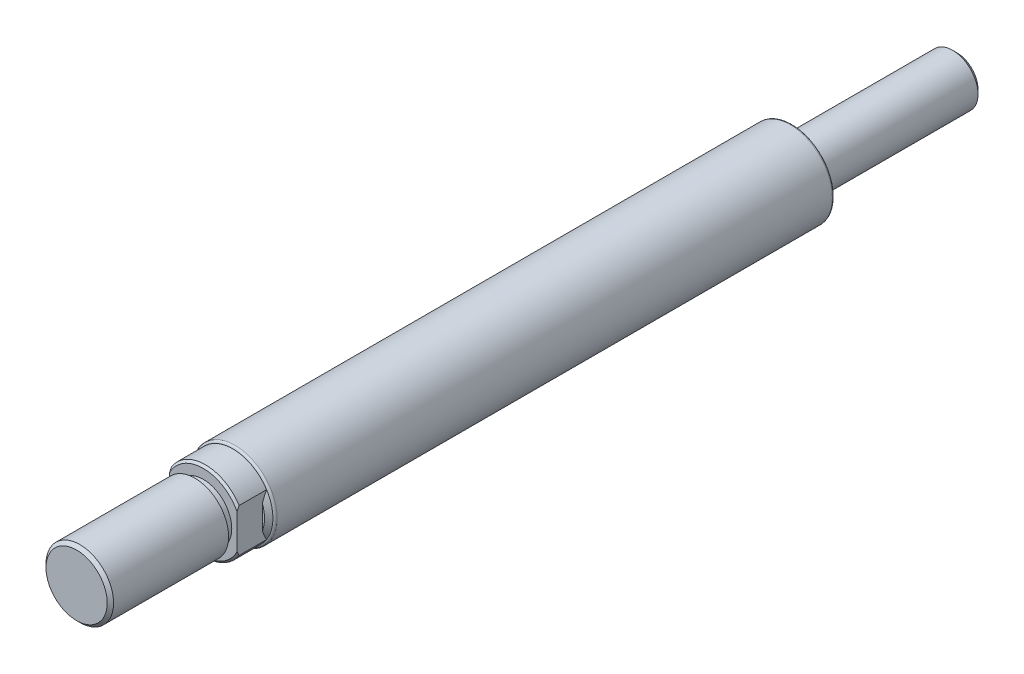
ISO-10303-21;
HEADER;
FILE_DESCRIPTION(('STEP AP214'),'2;1');
FILE_NAME('part.step','',(''),(''),'','','');
FILE_SCHEMA(('AUTOMOTIVE_DESIGN { 1 0 10303 214 1 1 1 1 }'));
ENDSEC;
DATA;
#1=APPLICATION_CONTEXT('core data for automotive mechanical design processes');
#2=APPLICATION_PROTOCOL_DEFINITION('international standard','automotive_design',2000,#1);
#3=PRODUCT_CONTEXT('',#1,'mechanical');
#4=PRODUCT('Part','Part','',(#3));
#5=PRODUCT_RELATED_PRODUCT_CATEGORY('part','',(#4));
#6=PRODUCT_DEFINITION_FORMATION('','',#4);
#7=PRODUCT_DEFINITION_CONTEXT('part definition',#1,'design');
#8=PRODUCT_DEFINITION('design','',#6,#7);
#9=PRODUCT_DEFINITION_SHAPE('','',#8);
#10=(LENGTH_UNIT() NAMED_UNIT(*) SI_UNIT(.MILLI.,.METRE.));
#11=(NAMED_UNIT(*) PLANE_ANGLE_UNIT() SI_UNIT($,.RADIAN.));
#12=(NAMED_UNIT(*) SI_UNIT($,.STERADIAN.) SOLID_ANGLE_UNIT());
#13=UNCERTAINTY_MEASURE_WITH_UNIT(LENGTH_MEASURE(1.E-05),#10,'distance_accuracy_value','');
#14=(GEOMETRIC_REPRESENTATION_CONTEXT(3) GLOBAL_UNCERTAINTY_ASSIGNED_CONTEXT((#13)) GLOBAL_UNIT_ASSIGNED_CONTEXT((#10,
#11,#12)) REPRESENTATION_CONTEXT('',''));
#15=CARTESIAN_POINT('',(0.,0.,0.));
#16=DIRECTION('',(0.,0.,1.));
#17=DIRECTION('',(1.,0.,0.));
#18=AXIS2_PLACEMENT_3D('',#15,#16,#17);
#19=CARTESIAN_POINT('',(0.,0.,30.));
#20=DIRECTION('',(0.,0.,1.));
#21=DIRECTION('',(0.999999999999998,0.,0.));
#22=AXIS2_PLACEMENT_3D('',#19,#20,#21);
#23=CYLINDRICAL_SURFACE('',#22,9.5);
#24=DIRECTION('',(0.,0.,1.));
#25=VECTOR('',#24,1.);
#26=CARTESIAN_POINT('',(8.00000000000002,5.12347538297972,30.));
#27=LINE('',#26,#25);
#28=CARTESIAN_POINT('',(8.00000000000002,5.12347538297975,-30.5));
#29=VERTEX_POINT('',#28);
#30=CARTESIAN_POINT('',(8.00000000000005,5.12347538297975,-37.));
#31=VERTEX_POINT('',#30);
#32=EDGE_CURVE('E233',#29,#31,#27,.F.);
#33=ORIENTED_EDGE('',*,*,#32,.T.);
#34=CARTESIAN_POINT('',(0.,0.,-37.));
#35=DIRECTION('',(0.,0.,1.));
#36=DIRECTION('',(0.999999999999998,0.,0.));
#37=AXIS2_PLACEMENT_3D('',#34,#35,#36);
#38=CIRCLE('',#37,9.5);
#39=CARTESIAN_POINT('',(-7.99999999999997,5.12347538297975,-37.));
#40=VERTEX_POINT('',#39);
#41=EDGE_CURVE('E243',#31,#40,#38,.T.);
#42=ORIENTED_EDGE('',*,*,#41,.T.);
#43=DIRECTION('',(0.,0.,1.));
#44=VECTOR('',#43,1.);
#45=CARTESIAN_POINT('',(-7.99999999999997,5.1234753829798,30.));
#46=LINE('',#45,#44);
#47=CARTESIAN_POINT('',(-7.99999999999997,5.12347538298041,-30.5));
#48=VERTEX_POINT('',#47);
#49=EDGE_CURVE('E267',#40,#48,#46,.T.);
#50=ORIENTED_EDGE('',*,*,#49,.T.);
#51=CARTESIAN_POINT('',(0.,0.,-30.5));
#52=DIRECTION('',(0.,0.,-1.));
#53=DIRECTION('',(-0.999999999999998,0.,0.));
#54=AXIS2_PLACEMENT_3D('',#51,#52,#53);
#55=CIRCLE('',#54,9.5);
#56=EDGE_CURVE('E134',#48,#29,#55,.T.);
#57=ORIENTED_EDGE('',*,*,#56,.T.);
#58=EDGE_LOOP('',(#33,#42,#50,#57));
#59=FACE_BOUND('',#58,.T.);
#60=ADVANCED_FACE('F38',(#59),#23,.T.);
#61=CARTESIAN_POINT('',(0.,0.,-30.));
#62=DIRECTION('',(0.,0.,-1.));
#63=DIRECTION('',(-0.999999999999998,0.,0.));
#64=AXIS2_PLACEMENT_3D('',#61,#62,#63);
#65=CONICAL_SURFACE('',#64,9.00000000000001,0.785398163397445);
#66=CARTESIAN_POINT('',(-7.99999999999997,-12.4805652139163,-35.824456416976));
#67=CARTESIAN_POINT('',(-7.99999999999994,-12.322472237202,-35.6913618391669));
#68=CARTESIAN_POINT('',(-7.99999999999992,-12.1640190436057,-35.5586953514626));
#69=CARTESIAN_POINT('',(-7.99999999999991,-11.8463165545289,-35.294315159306));
#70=CARTESIAN_POINT('',(-7.99999999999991,-11.6870672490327,-35.1626014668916));
#71=CARTESIAN_POINT('',(-7.99999999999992,-11.2079478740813,-34.7689821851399));
#72=CARTESIAN_POINT('',(-7.99999999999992,-10.8867753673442,-34.5086566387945));
#73=CARTESIAN_POINT('',(-7.99999999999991,-10.2380170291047,-33.9914726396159));
#74=CARTESIAN_POINT('',(-7.99999999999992,-9.91040226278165,-33.7346504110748));
#75=CARTESIAN_POINT('',(-7.99999999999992,-9.25001934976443,-33.22775645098));
#76=CARTESIAN_POINT('',(-7.99999999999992,-8.91725166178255,-32.9776841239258));
#77=CARTESIAN_POINT('',(-7.99999999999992,-8.25887278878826,-32.496113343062));
#78=CARTESIAN_POINT('',(-7.99999999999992,-7.9335129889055,-32.2642724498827));
#79=CARTESIAN_POINT('',(-7.99999999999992,-7.2755284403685,-31.810938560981));
#80=CARTESIAN_POINT('',(-7.99999999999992,-6.94290236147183,-31.5894474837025));
#81=CARTESIAN_POINT('',(-7.99999999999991,-6.26956184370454,-31.1607142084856));
#82=CARTESIAN_POINT('',(-7.9999999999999,-5.92886664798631,-30.9534419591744));
#83=CARTESIAN_POINT('',(-7.99999999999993,-5.23689572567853,-30.5574331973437));
#84=CARTESIAN_POINT('',(-7.99999999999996,-4.88562506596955,-30.3686879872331));
#85=CARTESIAN_POINT('',(-7.99999999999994,-4.37387150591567,-30.1166235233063));
#86=CARTESIAN_POINT('',(-7.99999999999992,-4.21844785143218,-30.0429980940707));
#87=CARTESIAN_POINT('',(-7.99999999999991,-3.90514290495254,-29.9011576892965));
#88=CARTESIAN_POINT('',(-7.99999999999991,-3.74726167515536,-29.832942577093));
#89=CARTESIAN_POINT('',(-7.99999999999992,-3.42918042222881,-29.702773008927));
#90=CARTESIAN_POINT('',(-7.99999999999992,-3.26898384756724,-29.6408101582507));
#91=CARTESIAN_POINT('',(-7.99999999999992,-2.94603757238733,-29.5238771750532));
#92=CARTESIAN_POINT('',(-7.99999999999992,-2.78328774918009,-29.4689073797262));
#93=CARTESIAN_POINT('',(-7.99999999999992,-2.45268168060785,-29.3660375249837));
#94=CARTESIAN_POINT('',(-7.99999999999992,-2.28478540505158,-29.3182653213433));
#95=CARTESIAN_POINT('',(-7.99999999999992,-1.94668439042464,-29.2318203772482));
#96=CARTESIAN_POINT('',(-7.99999999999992,-1.77648006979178,-29.1931460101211));
#97=CARTESIAN_POINT('',(-7.99999999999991,-1.43315589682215,-29.1256089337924));
#98=CARTESIAN_POINT('',(-7.99999999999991,-1.26002522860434,-29.0968006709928));
#99=CARTESIAN_POINT('',(-7.99999999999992,-0.912189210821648,-29.049979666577));
#100=CARTESIAN_POINT('',(-7.99999999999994,-0.737482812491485,-29.0319747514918));
#101=CARTESIAN_POINT('',(-7.99999999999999,-0.562330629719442,-29.0197391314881));
#102=B_SPLINE_CURVE_WITH_KNOTS('',3,(#66,#67,#68,#69,#70,#71,#72,#73,#74,#75,#76,#77,#78,#79,
#80,#81,#82,#83,#84,#85,#86,#87,#88,#89,#90,#91,#92,#93,#94,#95,#96,#97,#98,#99,#100,#101),
.UNSPECIFIED.,.F.,.F.,(4,2,2,2,2,2,2,2,2,2,2,2,2,2,2,2,2,4),(0.,0.619972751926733,
1.23995332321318,2.48018539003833,3.72895875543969,4.97762158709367,6.17600476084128,
7.37460919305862,8.57059692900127,9.76602049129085,10.2818793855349,10.7977252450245,
11.3128690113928,11.8280376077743,12.3514878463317,12.8748444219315,13.4010442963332,
13.9276249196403),.UNSPECIFIED.);
#103=CARTESIAN_POINT('',(-7.99999999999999,-5.12347538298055,-30.5));
#104=VERTEX_POINT('',#103);
#105=CARTESIAN_POINT('',(-7.99999999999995,-4.12310562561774,-30.0000000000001));
#106=VERTEX_POINT('',#105);
#107=EDGE_CURVE('E105',#104,#106,#102,.T.);
#108=ORIENTED_EDGE('',*,*,#107,.F.);
#109=CARTESIAN_POINT('',(8.00000000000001,-5.12347538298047,-30.5000000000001));
#110=VERTEX_POINT('',#109);
#111=EDGE_CURVE('E140',#110,#104,#55,.T.);
#112=ORIENTED_EDGE('',*,*,#111,.F.);
#113=CARTESIAN_POINT('',(7.99999999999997,-0.562330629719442,-29.019739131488));
#114=CARTESIAN_POINT('',(8.00000000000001,-0.692953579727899,-29.0288830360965));
#115=CARTESIAN_POINT('',(8.00000000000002,-0.823340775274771,-29.0412160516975));
#116=CARTESIAN_POINT('',(8.00000000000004,-1.08335782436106,-29.071992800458));
#117=CARTESIAN_POINT('',(8.00000000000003,-1.21298787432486,-29.0904348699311));
#118=CARTESIAN_POINT('',(8.00000000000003,-1.47102175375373,-29.133125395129));
#119=CARTESIAN_POINT('',(8.00000000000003,-1.59942749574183,-29.1573623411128));
#120=CARTESIAN_POINT('',(8.00000000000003,-1.85508108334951,-29.211315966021));
#121=CARTESIAN_POINT('',(8.00000000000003,-1.98232885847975,-29.2410329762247));
#122=CARTESIAN_POINT('',(8.00000000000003,-2.35920384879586,-29.3371043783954));
#123=CARTESIAN_POINT('',(8.00000000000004,-2.60695772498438,-29.4108917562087));
#124=CARTESIAN_POINT('',(8.00000000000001,-3.0967823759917,-29.5753571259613));
#125=CARTESIAN_POINT('',(7.99999999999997,-3.33885159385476,-29.6660396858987));
#126=CARTESIAN_POINT('',(8.00000000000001,-3.65836579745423,-29.7964917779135));
#127=CARTESIAN_POINT('',(8.00000000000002,-3.73838694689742,-29.8300828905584));
#128=CARTESIAN_POINT('',(8.00000000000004,-3.89777984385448,-29.8987366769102));
#129=CARTESIAN_POINT('',(8.00000000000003,-3.97715171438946,-29.9337990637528));
#130=CARTESIAN_POINT('',(8.00000000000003,-4.13548600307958,-30.0054007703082));
#131=CARTESIAN_POINT('',(8.00000000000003,-4.21444671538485,-30.0419438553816));
#132=CARTESIAN_POINT('',(8.00000000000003,-4.37174909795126,-30.1163258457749));
#133=CARTESIAN_POINT('',(8.00000000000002,-4.45009079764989,-30.1541646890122));
#134=CARTESIAN_POINT('',(7.99999999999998,-4.89771562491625,-30.3746464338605));
#135=CARTESIAN_POINT('',(8.00000000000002,-5.2606780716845,-30.5702240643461));
#136=CARTESIAN_POINT('',(8.00000000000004,-5.97540383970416,-30.9809788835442));
#137=CARTESIAN_POINT('',(8.00000000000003,-6.32716009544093,-31.1961681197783));
#138=CARTESIAN_POINT('',(8.00000000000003,-7.02247411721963,-31.6416036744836));
#139=CARTESIAN_POINT('',(8.00000000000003,-7.36600352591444,-31.8718940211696));
#140=CARTESIAN_POINT('',(8.00000000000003,-8.0454281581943,-32.3432410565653));
#141=CARTESIAN_POINT('',(8.00000000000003,-8.38132509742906,-32.5842952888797));
#142=CARTESIAN_POINT('',(8.00000000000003,-9.03826974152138,-33.0682362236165));
#143=CARTESIAN_POINT('',(8.00000000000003,-9.35947580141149,-33.3109088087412));
#144=CARTESIAN_POINT('',(8.00000000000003,-9.99716232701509,-33.8024231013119));
#145=CARTESIAN_POINT('',(8.00000000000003,-10.3136423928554,-34.0512653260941));
#146=CARTESIAN_POINT('',(8.00000000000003,-10.9403768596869,-34.5519926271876));
#147=CARTESIAN_POINT('',(8.00000000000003,-11.250659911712,-34.8038419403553));
#148=CARTESIAN_POINT('',(8.00000000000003,-11.8679206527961,-35.3114344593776));
#149=CARTESIAN_POINT('',(8.00000000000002,-12.1748990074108,-35.5671768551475));
#150=CARTESIAN_POINT('',(8.00000000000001,-12.4805652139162,-35.824456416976));
#151=B_SPLINE_CURVE_WITH_KNOTS('',3,(#113,#114,#115,#116,#117,#118,#119,#120,#121,#122,#123,
#124,#125,#126,#127,#128,#129,#130,#131,#132,#133,#134,#135,#136,#137,#138,#139,#140,#141,#142,
#143,#144,#145,#146,#147,#148,#149,#150),.UNSPECIFIED.,.F.,.F.,(4,2,2,2,2,2,2,2,2,2,2,2,2,2,2,2,
2,2,4),(0.,0.392770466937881,0.785434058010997,1.17732412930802,1.56923789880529,
2.34397803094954,3.11892793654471,3.37927663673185,3.63957480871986,3.90058251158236,
4.16157772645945,5.39748103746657,6.63414875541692,7.87459784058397,9.11476527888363,
10.3223857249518,11.5301077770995,12.7289611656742,13.927568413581),.UNSPECIFIED.);
#152=CARTESIAN_POINT('',(7.99999999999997,-4.12310562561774,-30.0000000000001));
#153=VERTEX_POINT('',#152);
#154=EDGE_CURVE('E131',#153,#110,#151,.T.);
#155=ORIENTED_EDGE('',*,*,#154,.F.);
#156=CARTESIAN_POINT('',(0.,0.,-30.));
#157=DIRECTION('',(0.,0.,-1.));
#158=DIRECTION('',(-0.999999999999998,0.,0.));
#159=AXIS2_PLACEMENT_3D('',#156,#157,#158);
#160=CIRCLE('',#159,9.00000000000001);
#161=EDGE_CURVE('E123',#106,#153,#160,.F.);
#162=ORIENTED_EDGE('',*,*,#161,.F.);
#163=EDGE_LOOP('',(#108,#112,#155,#162));
#164=FACE_BOUND('',#163,.T.);
#165=ADVANCED_FACE('F130',(#164),#65,.T.);
#166=CARTESIAN_POINT('',(0.,0.,0.));
#167=DIRECTION('',(0.,0.,-1.));
#168=DIRECTION('',(-0.999999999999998,0.,0.));
#169=AXIS2_PLACEMENT_3D('',#166,#167,#168);
#170=PLANE('',#169);
#171=CARTESIAN_POINT('',(0.,0.,0.));
#172=DIRECTION('',(0.,0.,-1.));
#173=DIRECTION('',(-0.999999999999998,0.,0.));
#174=AXIS2_PLACEMENT_3D('',#171,#172,#173);
#175=CIRCLE('',#174,7.25);
#176=CARTESIAN_POINT('',(-7.24999999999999,0.,0.));
#177=VERTEX_POINT('',#176);
#178=EDGE_CURVE('E136',#177,#177,#175,.F.);
#179=ORIENTED_EDGE('',*,*,#178,.T.);
#180=EDGE_LOOP('',(#179));
#181=FACE_BOUND('',#180,.T.);
#182=ADVANCED_FACE('F40',(#181),#170,.F.);
#183=CARTESIAN_POINT('',(0.,0.,30.));
#184=DIRECTION('',(0.,0.,1.));
#185=DIRECTION('',(0.999999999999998,0.,0.));
#186=AXIS2_PLACEMENT_3D('',#183,#184,#185);
#187=CYLINDRICAL_SURFACE('',#186,8.);
#188=CARTESIAN_POINT('',(0.,0.,-0.750000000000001));
#189=DIRECTION('',(0.,0.,-1.));
#190=DIRECTION('',(-0.999999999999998,0.,0.));
#191=AXIS2_PLACEMENT_3D('',#188,#189,#190);
#192=CIRCLE('',#191,8.);
#193=CARTESIAN_POINT('',(-7.99999999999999,0.,-0.750000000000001));
#194=VERTEX_POINT('',#193);
#195=EDGE_CURVE('E132',#194,#194,#192,.T.);
#196=ORIENTED_EDGE('',*,*,#195,.T.);
#197=EDGE_LOOP('',(#196));
#198=FACE_BOUND('',#197,.T.);
#199=CARTESIAN_POINT('',(0.,0.,-28.));
#200=DIRECTION('',(0.,0.,1.));
#201=DIRECTION('',(0.999999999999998,0.,0.));
#202=AXIS2_PLACEMENT_3D('',#199,#200,#201);
#203=CIRCLE('',#202,8.);
#204=CARTESIAN_POINT('',(7.99999999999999,0.,-28.));
#205=VERTEX_POINT('',#204);
#206=EDGE_CURVE('E357',#205,#205,#203,.T.);
#207=ORIENTED_EDGE('',*,*,#206,.T.);
#208=EDGE_LOOP('',(#207));
#209=FACE_BOUND('',#208,.T.);
#210=ADVANCED_FACE('F373',(#198,#209),#187,.T.);
#211=CARTESIAN_POINT('',(0.,7.99999999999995,-28.0000000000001));
#212=DIRECTION('',(0.,0.,1.));
#213=DIRECTION('',(0.999999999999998,0.,0.));
#214=AXIS2_PLACEMENT_3D('',#211,#212,#213);
#215=PLANE('',#214);
#216=ORIENTED_EDGE('',*,*,#206,.F.);
#217=EDGE_LOOP('',(#216));
#218=FACE_BOUND('',#217,.T.);
#219=CARTESIAN_POINT('',(0.,0.,-28.));
#220=DIRECTION('',(0.,0.,1.));
#221=DIRECTION('',(0.999999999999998,0.,0.));
#222=AXIS2_PLACEMENT_3D('',#219,#220,#221);
#223=CIRCLE('',#222,6.75);
#224=CARTESIAN_POINT('',(6.74999999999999,0.,-28.));
#225=VERTEX_POINT('',#224);
#226=EDGE_CURVE('E254',#225,#225,#223,.T.);
#227=ORIENTED_EDGE('',*,*,#226,.T.);
#228=EDGE_LOOP('',(#227));
#229=FACE_BOUND('',#228,.T.);
#230=ADVANCED_FACE('F364',(#218,#229),#215,.F.);
#231=CARTESIAN_POINT('',(0.,0.,30.));
#232=DIRECTION('',(0.,0.,1.));
#233=DIRECTION('',(0.999999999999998,0.,0.));
#234=AXIS2_PLACEMENT_3D('',#231,#232,#233);
#235=CYLINDRICAL_SURFACE('',#234,6.75);
#236=ORIENTED_EDGE('',*,*,#226,.F.);
#237=EDGE_LOOP('',(#236));
#238=FACE_BOUND('',#237,.T.);
#239=CARTESIAN_POINT('',(0.,0.,-30.));
#240=DIRECTION('',(0.,0.,1.));
#241=DIRECTION('',(0.999999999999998,0.,0.));
#242=AXIS2_PLACEMENT_3D('',#239,#240,#241);
#243=CIRCLE('',#242,6.75);
#244=CARTESIAN_POINT('',(6.74999999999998,0.,-30.));
#245=VERTEX_POINT('',#244);
#246=EDGE_CURVE('E251',#245,#245,#243,.T.);
#247=ORIENTED_EDGE('',*,*,#246,.T.);
#248=EDGE_LOOP('',(#247));
#249=FACE_BOUND('',#248,.T.);
#250=ADVANCED_FACE('F283',(#238,#249),#235,.T.);
#251=CARTESIAN_POINT('',(0.,6.74999999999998,-30.0000000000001));
#252=DIRECTION('',(0.,0.,-1.));
#253=DIRECTION('',(-0.999999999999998,0.,0.));
#254=AXIS2_PLACEMENT_3D('',#251,#252,#253);
#255=PLANE('',#254);
#256=CARTESIAN_POINT('',(8.00000000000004,4.12310562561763,-30.));
#257=VERTEX_POINT('',#256);
#258=CARTESIAN_POINT('',(-7.99999999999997,4.12310562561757,-30.));
#259=VERTEX_POINT('',#258);
#260=EDGE_CURVE('E126',#257,#259,#160,.F.);
#261=ORIENTED_EDGE('',*,*,#260,.T.);
#262=DIRECTION('',(0.,0.999999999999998,0.));
#263=VECTOR('',#262,1.);
#264=CARTESIAN_POINT('',(-7.99999999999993,5.99999999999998,-30.));
#265=LINE('',#264,#263);
#266=EDGE_CURVE('E108',#106,#259,#265,.T.);
#267=ORIENTED_EDGE('',*,*,#266,.F.);
#268=ORIENTED_EDGE('',*,*,#161,.T.);
#269=DIRECTION('',(0.,-0.999999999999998,0.));
#270=VECTOR('',#269,1.);
#271=CARTESIAN_POINT('',(8.00000000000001,6.,-30.));
#272=LINE('',#271,#270);
#273=EDGE_CURVE('E234',#257,#153,#272,.T.);
#274=ORIENTED_EDGE('',*,*,#273,.F.);
#275=EDGE_LOOP('',(#261,#267,#268,#274));
#276=FACE_BOUND('',#275,.T.);
#277=ORIENTED_EDGE('',*,*,#246,.F.);
#278=EDGE_LOOP('',(#277));
#279=FACE_BOUND('',#278,.T.);
#280=ADVANCED_FACE('F120',(#276,#279),#255,.F.);
#281=CARTESIAN_POINT('',(-7.99999999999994,-5.12347538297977,-37.));
#282=VERTEX_POINT('',#281);
#283=CARTESIAN_POINT('',(7.99999999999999,-5.12347538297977,-37.));
#284=VERTEX_POINT('',#283);
#285=EDGE_CURVE('E256',#282,#284,#38,.T.);
#286=ORIENTED_EDGE('',*,*,#285,.T.);
#287=DIRECTION('',(0.,0.,1.));
#288=VECTOR('',#287,1.);
#289=CARTESIAN_POINT('',(7.99999999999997,-5.12347538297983,29.9999999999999));
#290=LINE('',#289,#288);
#291=EDGE_CURVE('E227',#284,#110,#290,.T.);
#292=ORIENTED_EDGE('',*,*,#291,.T.);
#293=ORIENTED_EDGE('',*,*,#111,.T.);
#294=DIRECTION('',(0.,0.,1.));
#295=VECTOR('',#294,1.);
#296=CARTESIAN_POINT('',(-8.,-5.12347538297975,30.));
#297=LINE('',#296,#295);
#298=EDGE_CURVE('E110',#104,#282,#297,.F.);
#299=ORIENTED_EDGE('',*,*,#298,.T.);
#300=EDGE_LOOP('',(#286,#292,#293,#299));
#301=FACE_BOUND('',#300,.T.);
#302=ADVANCED_FACE('F272',(#301),#23,.T.);
#303=CARTESIAN_POINT('',(0.,0.,30.));
#304=DIRECTION('',(0.,0.,1.));
#305=DIRECTION('',(0.999999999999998,0.,0.));
#306=AXIS2_PLACEMENT_3D('',#303,#304,#305);
#307=CYLINDRICAL_SURFACE('',#306,10.);
#308=CARTESIAN_POINT('',(0.,0.,-37.5000000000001));
#309=DIRECTION('',(0.,0.,-1.));
#310=DIRECTION('',(-0.999999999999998,0.,0.));
#311=AXIS2_PLACEMENT_3D('',#308,#309,#310);
#312=CIRCLE('',#311,10.);
#313=CARTESIAN_POINT('',(-9.99999999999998,0.,-37.5000000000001));
#314=VERTEX_POINT('',#313);
#315=EDGE_CURVE('E145',#314,#314,#312,.T.);
#316=ORIENTED_EDGE('',*,*,#315,.T.);
#317=EDGE_LOOP('',(#316));
#318=FACE_BOUND('',#317,.T.);
#319=CARTESIAN_POINT('',(0.,0.,-169.));
#320=DIRECTION('',(0.,0.,1.));
#321=DIRECTION('',(0.999999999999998,0.,0.));
#322=AXIS2_PLACEMENT_3D('',#319,#320,#321);
#323=CIRCLE('',#322,10.);
#324=CARTESIAN_POINT('',(9.99999999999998,0.,-169.));
#325=VERTEX_POINT('',#324);
#326=EDGE_CURVE('E142',#325,#325,#323,.T.);
#327=ORIENTED_EDGE('',*,*,#326,.T.);
#328=EDGE_LOOP('',(#327));
#329=FACE_BOUND('',#328,.T.);
#330=ADVANCED_FACE('F274',(#318,#329),#307,.T.);
#331=CARTESIAN_POINT('',(0.,9.99999999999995,-169.5));
#332=DIRECTION('',(0.,0.,1.));
#333=DIRECTION('',(0.999999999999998,0.,0.));
#334=AXIS2_PLACEMENT_3D('',#331,#332,#333);
#335=PLANE('',#334);
#336=CARTESIAN_POINT('',(0.,0.,-169.5));
#337=DIRECTION('',(0.,0.,1.));
#338=DIRECTION('',(0.999999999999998,0.,0.));
#339=AXIS2_PLACEMENT_3D('',#336,#337,#338);
#340=CIRCLE('',#339,9.5);
#341=CARTESIAN_POINT('',(9.49999999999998,0.,-169.5));
#342=VERTEX_POINT('',#341);
#343=EDGE_CURVE('E148',#342,#342,#340,.F.);
#344=ORIENTED_EDGE('',*,*,#343,.T.);
#345=EDGE_LOOP('',(#344));
#346=FACE_BOUND('',#345,.T.);
#347=CARTESIAN_POINT('',(0.,0.,-169.5));
#348=DIRECTION('',(0.,0.,1.));
#349=DIRECTION('',(0.999999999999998,0.,0.));
#350=AXIS2_PLACEMENT_3D('',#347,#348,#349);
#351=CIRCLE('',#350,6.);
#352=CARTESIAN_POINT('',(5.99999999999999,0.,-169.5));
#353=VERTEX_POINT('',#352);
#354=EDGE_CURVE('E258',#353,#353,#351,.T.);
#355=ORIENTED_EDGE('',*,*,#354,.T.);
#356=EDGE_LOOP('',(#355));
#357=FACE_BOUND('',#356,.T.);
#358=ADVANCED_FACE('F280',(#346,#357),#335,.F.);
#359=CARTESIAN_POINT('',(0.,0.,30.));
#360=DIRECTION('',(0.,0.,1.));
#361=DIRECTION('',(0.999999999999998,0.,0.));
#362=AXIS2_PLACEMENT_3D('',#359,#360,#361);
#363=CYLINDRICAL_SURFACE('',#362,6.);
#364=CARTESIAN_POINT('',(0.,0.,-207.5));
#365=DIRECTION('',(0.,0.,1.));
#366=DIRECTION('',(0.999999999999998,0.,0.));
#367=AXIS2_PLACEMENT_3D('',#364,#365,#366);
#368=CIRCLE('',#367,6.);
#369=CARTESIAN_POINT('',(6.,0.,-207.5));
#370=VERTEX_POINT('',#369);
#371=EDGE_CURVE('E151',#370,#370,#368,.T.);
#372=ORIENTED_EDGE('',*,*,#371,.T.);
#373=EDGE_LOOP('',(#372));
#374=FACE_BOUND('',#373,.T.);
#375=ORIENTED_EDGE('',*,*,#354,.F.);
#376=EDGE_LOOP('',(#375));
#377=FACE_BOUND('',#376,.T.);
#378=ADVANCED_FACE('F304',(#374,#377),#363,.T.);
#379=CARTESIAN_POINT('',(0.,5.99999999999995,-208.5));
#380=DIRECTION('',(0.,0.,1.));
#381=DIRECTION('',(0.999999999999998,0.,0.));
#382=AXIS2_PLACEMENT_3D('',#379,#380,#381);
#383=PLANE('',#382);
#384=CARTESIAN_POINT('',(0.,0.,-208.5));
#385=DIRECTION('',(0.,0.,1.));
#386=DIRECTION('',(0.999999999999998,0.,0.));
#387=AXIS2_PLACEMENT_3D('',#384,#385,#386);
#388=CIRCLE('',#387,4.99999999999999);
#389=CARTESIAN_POINT('',(4.99999999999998,0.,-208.5));
#390=VERTEX_POINT('',#389);
#391=EDGE_CURVE('E154',#390,#390,#388,.F.);
#392=ORIENTED_EDGE('',*,*,#391,.T.);
#393=EDGE_LOOP('',(#392));
#394=FACE_BOUND('',#393,.T.);
#395=ADVANCED_FACE('F299',(#394),#383,.F.);
#396=CARTESIAN_POINT('',(0.,0.,0.));
#397=DIRECTION('',(0.,0.,-1.));
#398=DIRECTION('',(-0.999999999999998,0.,0.));
#399=AXIS2_PLACEMENT_3D('',#396,#397,#398);
#400=CONICAL_SURFACE('',#399,7.25,0.785398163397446);
#401=ORIENTED_EDGE('',*,*,#195,.F.);
#402=EDGE_LOOP('',(#401));
#403=FACE_BOUND('',#402,.T.);
#404=ORIENTED_EDGE('',*,*,#178,.F.);
#405=EDGE_LOOP('',(#404));
#406=FACE_BOUND('',#405,.T.);
#407=ADVANCED_FACE('F292',(#403,#406),#400,.T.);
#408=CARTESIAN_POINT('',(-7.99999999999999,0.562330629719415,-29.019739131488));
#409=CARTESIAN_POINT('',(-7.99999999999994,0.692953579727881,-29.0288830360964));
#410=CARTESIAN_POINT('',(-7.99999999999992,0.823340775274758,-29.0412160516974));
#411=CARTESIAN_POINT('',(-7.99999999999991,1.08335782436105,-29.0719928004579));
#412=CARTESIAN_POINT('',(-7.99999999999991,1.21298787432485,-29.090434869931));
#413=CARTESIAN_POINT('',(-7.99999999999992,1.47102175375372,-29.1331253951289));
#414=CARTESIAN_POINT('',(-7.99999999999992,1.5994274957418,-29.1573623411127));
#415=CARTESIAN_POINT('',(-7.99999999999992,1.85508108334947,-29.2113159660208));
#416=CARTESIAN_POINT('',(-7.99999999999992,1.98232885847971,-29.2410329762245));
#417=CARTESIAN_POINT('',(-7.99999999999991,2.35920384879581,-29.3371043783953));
#418=CARTESIAN_POINT('',(-7.9999999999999,2.60695772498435,-29.4108917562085));
#419=CARTESIAN_POINT('',(-7.99999999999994,3.09678237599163,-29.5753571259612));
#420=CARTESIAN_POINT('',(-7.99999999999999,3.33885159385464,-29.6660396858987));
#421=CARTESIAN_POINT('',(-7.99999999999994,3.65836579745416,-29.7964917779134));
#422=CARTESIAN_POINT('',(-7.99999999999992,3.73838694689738,-29.8300828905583));
#423=CARTESIAN_POINT('',(-7.99999999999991,3.89777984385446,-29.89873667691));
#424=CARTESIAN_POINT('',(-7.99999999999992,3.97715171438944,-29.9337990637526));
#425=CARTESIAN_POINT('',(-7.99999999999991,4.13548600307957,-30.0054007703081));
#426=CARTESIAN_POINT('',(-7.99999999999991,4.21444671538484,-30.0419438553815));
#427=CARTESIAN_POINT('',(-7.99999999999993,4.37174909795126,-30.1163258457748));
#428=CARTESIAN_POINT('',(-7.99999999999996,4.45009079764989,-30.1541646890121));
#429=CARTESIAN_POINT('',(-8.00000000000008,4.89771562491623,-30.3746464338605));
#430=CARTESIAN_POINT('',(-7.99999999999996,5.2606780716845,-30.570224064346));
#431=CARTESIAN_POINT('',(-7.99999999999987,5.97540383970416,-30.980978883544));
#432=CARTESIAN_POINT('',(-7.9999999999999,6.32716009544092,-31.1961681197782));
#433=CARTESIAN_POINT('',(-7.99999999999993,7.02247411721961,-31.6416036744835));
#434=CARTESIAN_POINT('',(-7.99999999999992,7.36600352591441,-31.8718940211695));
#435=CARTESIAN_POINT('',(-7.99999999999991,8.04542815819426,-32.3432410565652));
#436=CARTESIAN_POINT('',(-7.99999999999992,8.38132509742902,-32.5842952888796));
#437=CARTESIAN_POINT('',(-7.99999999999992,9.03826974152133,-33.0682362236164));
#438=CARTESIAN_POINT('',(-7.99999999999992,9.35947580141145,-33.3109088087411));
#439=CARTESIAN_POINT('',(-7.99999999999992,9.99716232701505,-33.8024231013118));
#440=CARTESIAN_POINT('',(-7.99999999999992,10.3136423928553,-34.051265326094));
#441=CARTESIAN_POINT('',(-7.99999999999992,10.9403768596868,-34.5519926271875));
#442=CARTESIAN_POINT('',(-7.99999999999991,11.250659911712,-34.8038419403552));
#443=CARTESIAN_POINT('',(-7.99999999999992,11.8679206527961,-35.3114344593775));
#444=CARTESIAN_POINT('',(-7.99999999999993,12.1748990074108,-35.5671768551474));
#445=CARTESIAN_POINT('',(-7.99999999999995,12.4805652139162,-35.8244564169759));
#446=B_SPLINE_CURVE_WITH_KNOTS('',3,(#408,#409,#410,#411,#412,#413,#414,#415,#416,#417,#418,
#419,#420,#421,#422,#423,#424,#425,#426,#427,#428,#429,#430,#431,#432,#433,#434,#435,#436,#437,
#438,#439,#440,#441,#442,#443,#444,#445),.UNSPECIFIED.,.F.,.F.,(4,2,2,2,2,2,2,2,2,2,2,2,2,2,2,2,
2,2,4),(0.,0.392770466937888,0.785434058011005,1.17732412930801,1.56923789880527,
2.3439780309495,3.11892793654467,3.37927663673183,3.63957480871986,3.90058251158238,
4.16157772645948,5.39748103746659,6.63414875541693,7.87459784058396,9.1147652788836,
10.3223857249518,11.5301077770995,12.7289611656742,13.9275684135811),.UNSPECIFIED.);
#447=EDGE_CURVE('E116',#259,#48,#446,.T.);
#448=ORIENTED_EDGE('',*,*,#447,.F.);
#449=ORIENTED_EDGE('',*,*,#260,.F.);
#450=CARTESIAN_POINT('',(8.00000000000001,12.4805652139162,-35.8244564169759));
#451=CARTESIAN_POINT('',(8.00000000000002,12.3224722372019,-35.6913618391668));
#452=CARTESIAN_POINT('',(8.00000000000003,12.1640190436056,-35.5586953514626));
#453=CARTESIAN_POINT('',(8.00000000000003,11.8463165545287,-35.294315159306));
#454=CARTESIAN_POINT('',(8.00000000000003,11.6870672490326,-35.1626014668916));
#455=CARTESIAN_POINT('',(8.00000000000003,11.2079478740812,-34.7689821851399));
#456=CARTESIAN_POINT('',(8.00000000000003,10.8867753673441,-34.5086566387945));
#457=CARTESIAN_POINT('',(8.00000000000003,10.2380170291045,-33.9914726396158));
#458=CARTESIAN_POINT('',(8.00000000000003,9.91040226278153,-33.7346504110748));
#459=CARTESIAN_POINT('',(8.00000000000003,9.25001934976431,-33.22775645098));
#460=CARTESIAN_POINT('',(8.00000000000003,8.91725166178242,-32.9776841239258));
#461=CARTESIAN_POINT('',(8.00000000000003,8.25887278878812,-32.496113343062));
#462=CARTESIAN_POINT('',(8.00000000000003,7.93351298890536,-32.2642724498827));
#463=CARTESIAN_POINT('',(8.00000000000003,7.27552844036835,-31.810938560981));
#464=CARTESIAN_POINT('',(8.00000000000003,6.94290236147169,-31.5894474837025));
#465=CARTESIAN_POINT('',(8.00000000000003,6.26956184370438,-31.1607142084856));
#466=CARTESIAN_POINT('',(8.00000000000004,5.92886664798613,-30.9534419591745));
#467=CARTESIAN_POINT('',(8.00000000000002,5.2368957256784,-30.5574331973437));
#468=CARTESIAN_POINT('',(7.99999999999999,4.88562506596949,-30.3686879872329));
#469=CARTESIAN_POINT('',(8.00000000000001,4.37387150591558,-30.1166235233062));
#470=CARTESIAN_POINT('',(8.00000000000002,4.21844785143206,-30.0429980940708));
#471=CARTESIAN_POINT('',(8.00000000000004,3.9051429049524,-29.9011576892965));
#472=CARTESIAN_POINT('',(8.00000000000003,3.74726167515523,-29.8329425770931));
#473=CARTESIAN_POINT('',(8.00000000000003,3.42918042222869,-29.7027730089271));
#474=CARTESIAN_POINT('',(8.00000000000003,3.26898384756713,-29.6408101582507));
#475=CARTESIAN_POINT('',(8.00000000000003,2.94603757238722,-29.5238771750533));
#476=CARTESIAN_POINT('',(8.00000000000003,2.78328774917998,-29.4689073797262));
#477=CARTESIAN_POINT('',(8.00000000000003,2.45268168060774,-29.3660375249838));
#478=CARTESIAN_POINT('',(8.00000000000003,2.28478540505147,-29.3182653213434));
#479=CARTESIAN_POINT('',(8.00000000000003,1.94668439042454,-29.2318203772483));
#480=CARTESIAN_POINT('',(8.00000000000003,1.77648006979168,-29.1931460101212));
#481=CARTESIAN_POINT('',(8.00000000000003,1.43315589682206,-29.1256089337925));
#482=CARTESIAN_POINT('',(8.00000000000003,1.26002522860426,-29.0968006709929));
#483=CARTESIAN_POINT('',(8.00000000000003,0.912189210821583,-29.0499796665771));
#484=CARTESIAN_POINT('',(8.00000000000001,0.737482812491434,-29.0319747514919));
#485=CARTESIAN_POINT('',(7.99999999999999,0.562330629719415,-29.019739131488));
#486=B_SPLINE_CURVE_WITH_KNOTS('',3,(#450,#451,#452,#453,#454,#455,#456,#457,#458,#459,#460,
#461,#462,#463,#464,#465,#466,#467,#468,#469,#470,#471,#472,#473,#474,#475,#476,#477,#478,#479,
#480,#481,#482,#483,#484,#485),.UNSPECIFIED.,.F.,.F.,(4,2,2,2,2,2,2,2,2,2,2,2,2,2,2,2,2,4),(0.,
0.61997275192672,1.23995332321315,2.4801853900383,3.72895875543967,4.97762158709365,
6.17600476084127,7.37460919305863,8.57059692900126,9.76602049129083,10.2818793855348,
10.7977252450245,11.3128690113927,11.8280376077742,12.3514878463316,12.8748444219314,
13.4010442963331,13.9276249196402),.UNSPECIFIED.);
#487=EDGE_CURVE('E157',#29,#257,#486,.T.);
#488=ORIENTED_EDGE('',*,*,#487,.F.);
#489=ORIENTED_EDGE('',*,*,#56,.F.);
#490=EDGE_LOOP('',(#448,#449,#488,#489));
#491=FACE_BOUND('',#490,.T.);
#492=ADVANCED_FACE('F168',(#491),#65,.T.);
#493=CARTESIAN_POINT('',(0.,0.,-37.5000000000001));
#494=DIRECTION('',(0.,0.,-1.));
#495=DIRECTION('',(-0.999999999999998,0.,0.));
#496=AXIS2_PLACEMENT_3D('',#493,#494,#495);
#497=TOROIDAL_SURFACE('',#496,9.5,0.5);
#498=ORIENTED_EDGE('',*,*,#315,.F.);
#499=EDGE_LOOP('',(#498));
#500=FACE_BOUND('',#499,.T.);
#501=ORIENTED_EDGE('',*,*,#41,.F.);
#502=EDGE_CURVE('E236',#284,#31,#38,.T.);
#503=ORIENTED_EDGE('',*,*,#502,.F.);
#504=ORIENTED_EDGE('',*,*,#285,.F.);
#505=EDGE_CURVE('E248',#40,#282,#38,.T.);
#506=ORIENTED_EDGE('',*,*,#505,.F.);
#507=EDGE_LOOP('',(#501,#503,#504,#506));
#508=FACE_BOUND('',#507,.T.);
#509=ADVANCED_FACE('F244',(#500,#508),#497,.T.);
#510=CARTESIAN_POINT('',(0.,0.,-169.));
#511=DIRECTION('',(0.,0.,1.));
#512=DIRECTION('',(0.999999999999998,0.,0.));
#513=AXIS2_PLACEMENT_3D('',#510,#511,#512);
#514=TOROIDAL_SURFACE('',#513,9.5,0.5);
#515=ORIENTED_EDGE('',*,*,#343,.F.);
#516=EDGE_LOOP('',(#515));
#517=FACE_BOUND('',#516,.T.);
#518=ORIENTED_EDGE('',*,*,#326,.F.);
#519=EDGE_LOOP('',(#518));
#520=FACE_BOUND('',#519,.T.);
#521=ADVANCED_FACE('F297',(#517,#520),#514,.T.);
#522=CARTESIAN_POINT('',(0.,0.,-207.5));
#523=DIRECTION('',(0.,0.,1.));
#524=DIRECTION('',(0.999999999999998,0.,0.));
#525=AXIS2_PLACEMENT_3D('',#522,#523,#524);
#526=CONICAL_SURFACE('',#525,6.,0.785398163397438);
#527=ORIENTED_EDGE('',*,*,#391,.F.);
#528=EDGE_LOOP('',(#527));
#529=FACE_BOUND('',#528,.T.);
#530=ORIENTED_EDGE('',*,*,#371,.F.);
#531=EDGE_LOOP('',(#530));
#532=FACE_BOUND('',#531,.T.);
#533=ADVANCED_FACE('F180',(#529,#532),#526,.T.);
#534=CARTESIAN_POINT('',(0.,0.,-36.));
#535=DIRECTION('',(0.,0.,1.));
#536=DIRECTION('',(0.999999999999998,0.,0.));
#537=AXIS2_PLACEMENT_3D('',#534,#535,#536);
#538=PLANE('',#537);
#539=DIRECTION('',(0.,-0.999999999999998,0.));
#540=VECTOR('',#539,1.);
#541=CARTESIAN_POINT('',(8.00000000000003,5.99999999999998,-36.));
#542=LINE('',#541,#540);
#543=CARTESIAN_POINT('',(8.00000000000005,2.87228132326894,-36.));
#544=VERTEX_POINT('',#543);
#545=CARTESIAN_POINT('',(8.,-2.872281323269,-36.0000000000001));
#546=VERTEX_POINT('',#545);
#547=EDGE_CURVE('E225',#544,#546,#542,.T.);
#548=ORIENTED_EDGE('',*,*,#547,.T.);
#549=CARTESIAN_POINT('',(0.,0.,-36.));
#550=DIRECTION('',(0.,0.,1.));
#551=DIRECTION('',(0.999999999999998,0.,0.));
#552=AXIS2_PLACEMENT_3D('',#549,#550,#551);
#553=CIRCLE('',#552,8.49999999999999);
#554=EDGE_CURVE('E115',#546,#544,#553,.T.);
#555=ORIENTED_EDGE('',*,*,#554,.T.);
#556=EDGE_LOOP('',(#548,#555));
#557=FACE_BOUND('',#556,.T.);
#558=ADVANCED_FACE('F178',(#557),#538,.T.);
#559=CARTESIAN_POINT('',(8.00000000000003,5.99999999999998,-36.));
#560=DIRECTION('',(-0.999999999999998,0.,0.));
#561=DIRECTION('',(0.,0.,1.));
#562=AXIS2_PLACEMENT_3D('',#559,#560,#561);
#563=PLANE('',#562);
#564=ORIENTED_EDGE('',*,*,#547,.F.);
#565=CARTESIAN_POINT('',(8.00000000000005,2.87228132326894,-36.));
#566=CARTESIAN_POINT('',(8.00000000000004,3.06722326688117,-36.0658885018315));
#567=CARTESIAN_POINT('',(8.00000000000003,3.26030628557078,-36.1370606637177));
#568=CARTESIAN_POINT('',(8.00000000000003,3.64250565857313,-36.2884612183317));
#569=CARTESIAN_POINT('',(8.00000000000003,3.83162841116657,-36.3686734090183));
#570=CARTESIAN_POINT('',(8.00000000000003,4.20628589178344,-36.5368583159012));
#571=CARTESIAN_POINT('',(8.00000000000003,4.39182174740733,-36.6248285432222));
#572=CARTESIAN_POINT('',(8.00000000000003,4.75991570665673,-36.80759665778));
#573=CARTESIAN_POINT('',(8.00000000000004,4.94246797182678,-36.9024063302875));
#574=CARTESIAN_POINT('',(8.00000000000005,5.12347538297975,-37.));
#575=B_SPLINE_CURVE_WITH_KNOTS('',3,(#565,#566,#567,#568,#569,#570,#571,#572,#573,#574),
.UNSPECIFIED.,.F.,.F.,(4,2,2,2,4),(0.,0.617151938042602,1.23321486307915,1.84908086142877,
2.46603466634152),.UNSPECIFIED.);
#576=EDGE_CURVE('E187',#544,#31,#575,.T.);
#577=ORIENTED_EDGE('',*,*,#576,.T.);
#578=ORIENTED_EDGE('',*,*,#32,.F.);
#579=ORIENTED_EDGE('',*,*,#487,.T.);
#580=ORIENTED_EDGE('',*,*,#273,.T.);
#581=ORIENTED_EDGE('',*,*,#154,.T.);
#582=ORIENTED_EDGE('',*,*,#291,.F.);
#583=CARTESIAN_POINT('',(7.99999999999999,-5.12347538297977,-37.0000000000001));
#584=CARTESIAN_POINT('',(8.00000000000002,-4.94246797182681,-36.9024063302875));
#585=CARTESIAN_POINT('',(8.00000000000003,-4.75991570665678,-36.80759665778));
#586=CARTESIAN_POINT('',(8.00000000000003,-4.39182174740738,-36.6248285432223));
#587=CARTESIAN_POINT('',(8.00000000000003,-4.2062858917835,-36.5368583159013));
#588=CARTESIAN_POINT('',(8.00000000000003,-3.83162841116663,-36.3686734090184));
#589=CARTESIAN_POINT('',(8.00000000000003,-3.64250565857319,-36.2884612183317));
#590=CARTESIAN_POINT('',(8.00000000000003,-3.26030628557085,-36.1370606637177));
#591=CARTESIAN_POINT('',(8.00000000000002,-3.06722326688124,-36.0658885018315));
#592=CARTESIAN_POINT('',(8.,-2.872281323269,-36.0000000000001));
#593=B_SPLINE_CURVE_WITH_KNOTS('',3,(#583,#584,#585,#586,#587,#588,#589,#590,#591,#592),
.UNSPECIFIED.,.F.,.F.,(4,2,2,2,4),(0.,0.616953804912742,1.23281980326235,1.84888272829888,
2.46603466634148),.UNSPECIFIED.);
#594=EDGE_CURVE('E194',#284,#546,#593,.T.);
#595=ORIENTED_EDGE('',*,*,#594,.T.);
#596=EDGE_LOOP('',(#564,#577,#578,#579,#580,#581,#582,#595));
#597=FACE_BOUND('',#596,.T.);
#598=ADVANCED_FACE('F172',(#597),#563,.F.);
#599=CARTESIAN_POINT('',(0.,0.,-36.));
#600=DIRECTION('',(0.,0.,-1.));
#601=DIRECTION('',(-0.999999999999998,0.,0.));
#602=AXIS2_PLACEMENT_3D('',#599,#600,#601);
#603=PLANE('',#602);
#604=DIRECTION('',(0.,0.999999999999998,0.));
#605=VECTOR('',#604,1.);
#606=CARTESIAN_POINT('',(-7.99999999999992,6.,-36.));
#607=LINE('',#606,#605);
#608=CARTESIAN_POINT('',(-7.99999999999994,-2.87228132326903,-36.0000000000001));
#609=VERTEX_POINT('',#608);
#610=CARTESIAN_POINT('',(-8.00000000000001,2.87228132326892,-36.));
#611=VERTEX_POINT('',#610);
#612=EDGE_CURVE('E127',#609,#611,#607,.T.);
#613=ORIENTED_EDGE('',*,*,#612,.T.);
#614=CARTESIAN_POINT('',(0.,0.,-36.));
#615=DIRECTION('',(0.,0.,-1.));
#616=DIRECTION('',(-0.999999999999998,0.,0.));
#617=AXIS2_PLACEMENT_3D('',#614,#615,#616);
#618=CIRCLE('',#617,8.49999999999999);
#619=EDGE_CURVE('E63',#611,#609,#618,.F.);
#620=ORIENTED_EDGE('',*,*,#619,.T.);
#621=EDGE_LOOP('',(#613,#620));
#622=FACE_BOUND('',#621,.T.);
#623=ADVANCED_FACE('F177',(#622),#603,.F.);
#624=CARTESIAN_POINT('',(-7.99999999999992,6.,-36.));
#625=DIRECTION('',(0.999999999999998,0.,0.));
#626=DIRECTION('',(0.,0.,-1.));
#627=AXIS2_PLACEMENT_3D('',#624,#625,#626);
#628=PLANE('',#627);
#629=ORIENTED_EDGE('',*,*,#107,.T.);
#630=ORIENTED_EDGE('',*,*,#266,.T.);
#631=ORIENTED_EDGE('',*,*,#447,.T.);
#632=ORIENTED_EDGE('',*,*,#49,.F.);
#633=CARTESIAN_POINT('',(-7.99999999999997,5.12347538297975,-37.));
#634=CARTESIAN_POINT('',(-7.99999999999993,4.9424679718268,-36.9024063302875));
#635=CARTESIAN_POINT('',(-7.99999999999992,4.75991570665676,-36.8075966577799));
#636=CARTESIAN_POINT('',(-7.99999999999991,4.39182174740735,-36.6248285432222));
#637=CARTESIAN_POINT('',(-7.99999999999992,4.20628589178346,-36.5368583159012));
#638=CARTESIAN_POINT('',(-7.99999999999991,3.83162841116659,-36.3686734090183));
#639=CARTESIAN_POINT('',(-7.99999999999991,3.64250565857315,-36.2884612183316));
#640=CARTESIAN_POINT('',(-7.99999999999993,3.26030628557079,-36.1370606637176));
#641=CARTESIAN_POINT('',(-7.99999999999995,3.06722326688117,-36.0658885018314));
#642=CARTESIAN_POINT('',(-8.00000000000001,2.87228132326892,-36.));
#643=B_SPLINE_CURVE_WITH_KNOTS('',3,(#633,#634,#635,#636,#637,#638,#639,#640,#641,#642),
.UNSPECIFIED.,.F.,.F.,(4,2,2,2,4),(0.,0.616953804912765,1.23281980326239,1.84888272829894,
2.46603466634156),.UNSPECIFIED.);
#644=EDGE_CURVE('E51',#40,#611,#643,.T.);
#645=ORIENTED_EDGE('',*,*,#644,.T.);
#646=ORIENTED_EDGE('',*,*,#612,.F.);
#647=CARTESIAN_POINT('',(-7.99999999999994,-2.87228132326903,-36.0000000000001));
#648=CARTESIAN_POINT('',(-7.99999999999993,-3.06722326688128,-36.0658885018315));
#649=CARTESIAN_POINT('',(-7.99999999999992,-3.26030628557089,-36.1370606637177));
#650=CARTESIAN_POINT('',(-7.99999999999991,-3.64250565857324,-36.2884612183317));
#651=CARTESIAN_POINT('',(-7.99999999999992,-3.83162841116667,-36.3686734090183));
#652=CARTESIAN_POINT('',(-7.99999999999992,-4.20628589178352,-36.5368583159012));
#653=CARTESIAN_POINT('',(-7.99999999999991,-4.39182174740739,-36.6248285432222));
#654=CARTESIAN_POINT('',(-7.99999999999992,-4.75991570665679,-36.80759665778));
#655=CARTESIAN_POINT('',(-7.99999999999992,-4.94246797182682,-36.9024063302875));
#656=CARTESIAN_POINT('',(-7.99999999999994,-5.12347538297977,-37.));
#657=B_SPLINE_CURVE_WITH_KNOTS('',3,(#647,#648,#649,#650,#651,#652,#653,#654,#655,#656),
.UNSPECIFIED.,.F.,.F.,(4,2,2,2,4),(0.,0.617151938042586,1.23321486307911,1.8490808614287,
2.46603466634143),.UNSPECIFIED.);
#658=EDGE_CURVE('E13',#609,#282,#657,.T.);
#659=ORIENTED_EDGE('',*,*,#658,.T.);
#660=ORIENTED_EDGE('',*,*,#298,.F.);
#661=EDGE_LOOP('',(#629,#630,#631,#632,#645,#646,#659,#660));
#662=FACE_BOUND('',#661,.T.);
#663=ADVANCED_FACE('F107',(#662),#628,.F.);
#664=CARTESIAN_POINT('',(0.,0.,-36.));
#665=DIRECTION('',(0.,0.,-1.));
#666=DIRECTION('',(-0.999999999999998,0.,0.));
#667=AXIS2_PLACEMENT_3D('',#664,#665,#666);
#668=CONICAL_SURFACE('',#667,8.49999999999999,0.785398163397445);
#669=ORIENTED_EDGE('',*,*,#594,.F.);
#670=ORIENTED_EDGE('',*,*,#502,.T.);
#671=ORIENTED_EDGE('',*,*,#576,.F.);
#672=ORIENTED_EDGE('',*,*,#554,.F.);
#673=EDGE_LOOP('',(#669,#670,#671,#672));
#674=FACE_BOUND('',#673,.T.);
#675=ADVANCED_FACE('F199',(#674),#668,.T.);
#676=CARTESIAN_POINT('',(0.,0.,-37.));
#677=DIRECTION('',(0.,0.,-1.));
#678=DIRECTION('',(-0.999999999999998,0.,0.));
#679=AXIS2_PLACEMENT_3D('',#676,#677,#678);
#680=CONICAL_SURFACE('',#679,9.5,0.785398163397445);
#681=ORIENTED_EDGE('',*,*,#658,.F.);
#682=ORIENTED_EDGE('',*,*,#619,.F.);
#683=ORIENTED_EDGE('',*,*,#644,.F.);
#684=ORIENTED_EDGE('',*,*,#505,.T.);
#685=EDGE_LOOP('',(#681,#682,#683,#684));
#686=FACE_BOUND('',#685,.T.);
#687=ADVANCED_FACE('F203',(#686),#680,.T.);
#688=CLOSED_SHELL('',(#60,#165,#182,#210,#230,#250,#280,#302,#330,#358,#378,#395,#407,#492,#509,
#521,#533,#558,#598,#623,#663,#675,#687));
#689=MANIFOLD_SOLID_BREP('B2',#688);
#690=ADVANCED_BREP_SHAPE_REPRESENTATION('',(#18,#689),#14);
#691=SHAPE_DEFINITION_REPRESENTATION(#9,#690);
ENDSEC;
END-ISO-10303-21;
